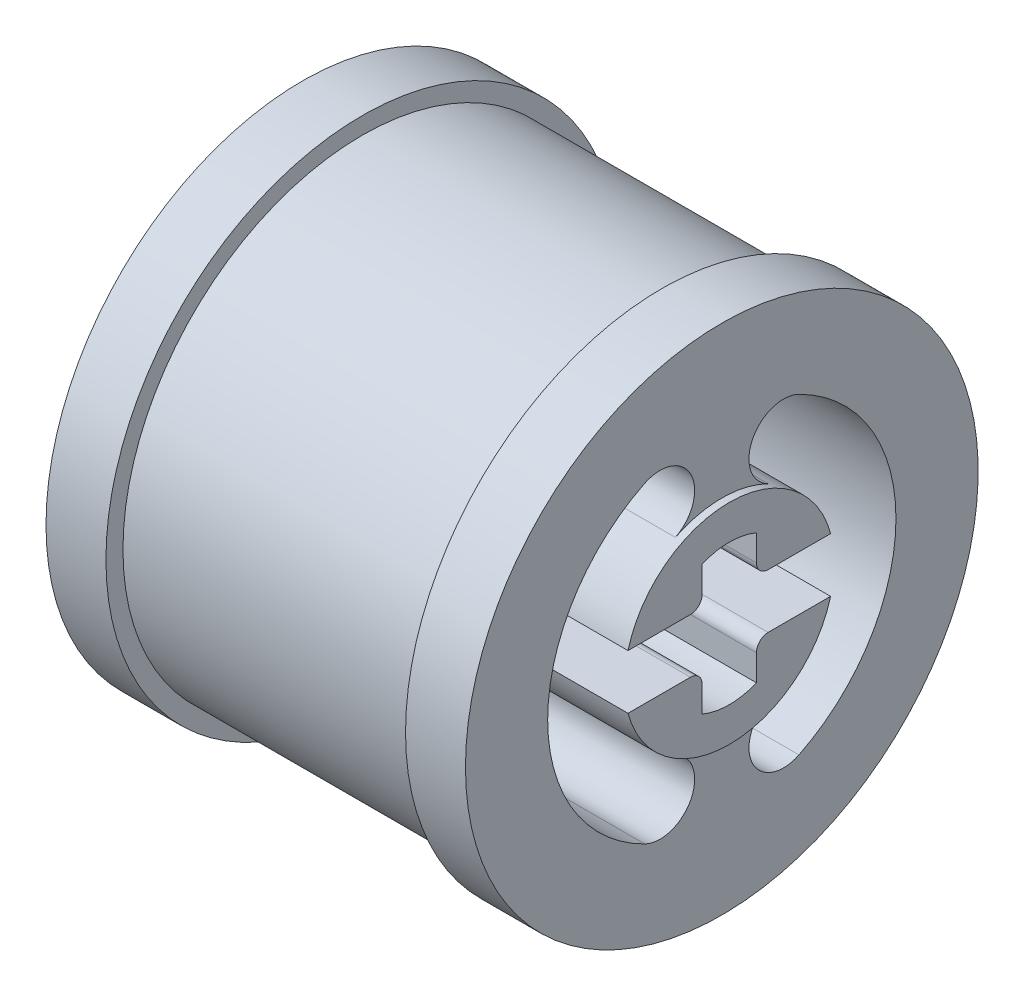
from build123d import *
from build123d.topology import SkipClean

# Parameters (mm, degrees)
SKETCH2_R           = 3.556
BOSS_EXTRUDE1_DEPTH = 0.254
CUT_EXTRUDE1_DEPTH  = 15.202896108
CUT_EXTRUDE2_DEPTH  = 15.331771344
FILLET1_R           = 0.396875


with BuildPart() as part:
    # Sketch1 → Base-Revolve (revolve)
    with BuildSketch(Plane.XY, mode=Mode.PRIVATE) as base_revolve_sk:
        Polygon((7.112, 0), (7.112, 8.69315), (5.08, 8.69315), (5.08, 8.1153), (3.556, 8.1153), (0, 8.1153), (0, 0), align=None)
    revolve(base_revolve_sk.sketch.rotate(Axis((0, 0, 0), (1, 0, 0)), 90), axis=Axis((0, 0, 0), (1, 0, 0)))

    # Sketch2 → Boss-Extrude1 (add)
    with BuildSketch(Plane(origin=(7.112, 0, 0), x_dir=(0, 0, -1), z_dir=(1, 0, 0))):
        with Locations(Location((0, 0, 0), (0, 0, 180))):
            Circle(SKETCH2_R)
    extrude(amount=BOSS_EXTRUDE1_DEPTH)

    # Sketch3 → Cut-Extrude1 (cut, through all)
    with SkipClean():  # the faces are left unmerged after this step: merging them gives an invalid solid
        with BuildSketch(Plane(origin=(7.112, 0, 0), x_dir=(0, 0, -1), z_dir=(1, 0, 0))):
            with BuildLine():
                ThreePointArc((2.61585906, -5.29454546), (5.9055, 0), (2.61585906, 5.29454546))
                ThreePointArc((2.61585906, 5.29454546), (1.042283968, 4.761688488), (1.57514094, 3.188113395))
                ThreePointArc((1.57514094, 3.188113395), (3.556, 0), (1.57514094, -3.188113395))
                ThreePointArc((1.57514094, -3.188113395), (1.042283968, -4.761688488), (2.61585906, -5.29454546))
            make_face()
            with BuildLine():
                ThreePointArc((-2.61585906, -5.29454546), (-1.042283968, -4.761688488), (-1.57514094, -3.188113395))
                ThreePointArc((-1.57514094, -3.188113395), (-3.556, 0), (-1.57514094, 3.188113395))
                ThreePointArc((-1.57514094, 3.188113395), (-1.042283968, 4.761688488), (-2.61585906, 5.29454546))
                ThreePointArc((-2.61585906, 5.29454546), (-5.9055, 0), (-2.61585906, -5.29454546))
            make_face()
        extrude(amount=-CUT_EXTRUDE1_DEPTH, mode=Mode.SUBTRACT)

    # Sketch4 → Cut-Extrude2 (cut, through all)
    with SkipClean():  # the faces are left unmerged after this step: merging them gives an invalid solid
        with BuildSketch(Plane(origin=(7.366, 0, 0), x_dir=(0, 0, -1), z_dir=(1, 0, 0))):
            with BuildLine():
                Line((3.434727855, 0.92075), (0.92075, 0.92075))
                Line((0.92075, 0.92075), (0.92075, 2.202919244))
                ThreePointArc((0.92075, 2.202919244), (0, 2.3876), (-0.92075, 2.202919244))
                Line((-0.92075, 2.202919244), (-0.92075, 0.92075))
                Line((-0.92075, 0.92075), (-3.434727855, 0.92075))
                ThreePointArc((-3.434727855, 0.92075), (-3.556, 0), (-3.434727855, -0.92075))
                Line((-3.434727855, -0.92075), (-0.92075, -0.92075))
                Line((-0.92075, -0.92075), (-0.92075, -2.202919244))
                ThreePointArc((-0.92075, -2.202919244), (0, -2.3876), (0.92075, -2.202919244))
                Line((0.92075, -2.202919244), (0.92075, -0.92075))
                Line((0.92075, -0.92075), (3.434727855, -0.92075))
                ThreePointArc((3.434727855, -0.92075), (3.556, 0), (3.434727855, 0.92075))
            make_face()
        extrude(amount=-CUT_EXTRUDE2_DEPTH, mode=Mode.SUBTRACT)

    # Fillet1
    fillet1_edges = [part.edges().sort_by_distance(p)[0] for p in [
        (3.683, -0.92075, -0.92075),
        (3.683, -0.92075, 0.92075),
        (3.683, 0.92075, 0.92075),
        (3.683, 0.92075, -0.92075),
    ]]
    fillet(fillet1_edges, radius=FILLET1_R)

    # Boss-Mirror1: part across face


with BuildPart() as part_1:
    with SkipClean():  # the faces are left unmerged after this step: merging them gives an invalid solid
        add(part.part)
        add(part.part.mirror(Plane.ZY))


solid = part_1.part
